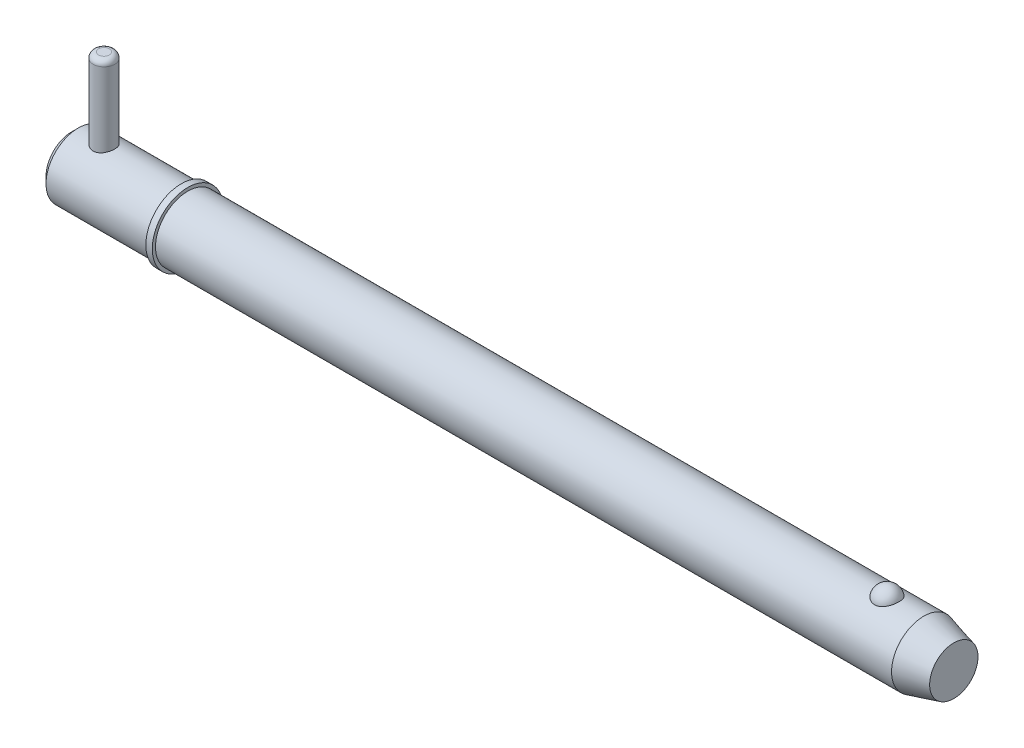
ISO-10303-21;
HEADER;
FILE_DESCRIPTION(('STEP AP214'),'2;1');
FILE_NAME('part.step','',(''),(''),'','','');
FILE_SCHEMA(('AUTOMOTIVE_DESIGN { 1 0 10303 214 1 1 1 1 }'));
ENDSEC;
DATA;
#1=APPLICATION_CONTEXT('core data for automotive mechanical design processes');
#2=APPLICATION_PROTOCOL_DEFINITION('international standard','automotive_design',2000,#1);
#3=PRODUCT_CONTEXT('',#1,'mechanical');
#4=PRODUCT('Part','Part','',(#3));
#5=PRODUCT_RELATED_PRODUCT_CATEGORY('part','',(#4));
#6=PRODUCT_DEFINITION_FORMATION('','',#4);
#7=PRODUCT_DEFINITION_CONTEXT('part definition',#1,'design');
#8=PRODUCT_DEFINITION('design','',#6,#7);
#9=PRODUCT_DEFINITION_SHAPE('','',#8);
#10=(LENGTH_UNIT() NAMED_UNIT(*) SI_UNIT(.MILLI.,.METRE.));
#11=(NAMED_UNIT(*) PLANE_ANGLE_UNIT() SI_UNIT($,.RADIAN.));
#12=(NAMED_UNIT(*) SI_UNIT($,.STERADIAN.) SOLID_ANGLE_UNIT());
#13=UNCERTAINTY_MEASURE_WITH_UNIT(LENGTH_MEASURE(1.E-05),#10,'distance_accuracy_value','');
#14=(GEOMETRIC_REPRESENTATION_CONTEXT(3) GLOBAL_UNCERTAINTY_ASSIGNED_CONTEXT((#13)) GLOBAL_UNIT_ASSIGNED_CONTEXT((#10,
#11,#12)) REPRESENTATION_CONTEXT('',''));
#15=CARTESIAN_POINT('',(0.,0.,0.));
#16=DIRECTION('',(0.,0.,1.));
#17=DIRECTION('',(1.,0.,0.));
#18=AXIS2_PLACEMENT_3D('',#15,#16,#17);
#19=CARTESIAN_POINT('',(7.14,24.605,0.));
#20=DIRECTION('',(0.,-1.,0.));
#21=DIRECTION('',(0.,0.,-1.));
#22=AXIS2_PLACEMENT_3D('',#19,#20,#21);
#23=CYLINDRICAL_SURFACE('',#22,2.38);
#24=CARTESIAN_POINT('',(7.14,-5.955,0.));
#25=DIRECTION('',(0.,1.,0.));
#26=DIRECTION('',(0.,0.,1.));
#27=AXIS2_PLACEMENT_3D('',#24,#25,#26);
#28=CIRCLE('',#27,2.38);
#29=CARTESIAN_POINT('',(7.14,-5.955,2.38));
#30=VERTEX_POINT('',#29);
#31=EDGE_CURVE('P0_E25',#30,#30,#28,.T.);
#32=ORIENTED_EDGE('',*,*,#31,.T.);
#33=EDGE_LOOP('',(#32));
#34=FACE_BOUND('',#33,.T.);
#35=CARTESIAN_POINT('',(7.14,23.415,0.));
#36=DIRECTION('',(0.,1.,0.));
#37=DIRECTION('',(0.,0.,1.));
#38=AXIS2_PLACEMENT_3D('',#35,#36,#37);
#39=CIRCLE('',#38,2.38);
#40=CARTESIAN_POINT('',(7.14,23.415,2.38));
#41=VERTEX_POINT('',#40);
#42=EDGE_CURVE('P0_E29',#41,#41,#39,.F.);
#43=ORIENTED_EDGE('',*,*,#42,.T.);
#44=EDGE_LOOP('',(#43));
#45=FACE_BOUND('',#44,.T.);
#46=ADVANCED_FACE('P0_F14',(#34,#45),#23,.T.);
#47=CARTESIAN_POINT('',(7.14,24.605,0.));
#48=DIRECTION('',(0.,1.,0.));
#49=DIRECTION('',(0.,0.,1.));
#50=AXIS2_PLACEMENT_3D('',#47,#48,#49);
#51=PLANE('',#50);
#52=CARTESIAN_POINT('',(7.14,24.605,0.));
#53=DIRECTION('',(0.,1.,0.));
#54=DIRECTION('',(0.,0.,1.));
#55=AXIS2_PLACEMENT_3D('',#52,#53,#54);
#56=CIRCLE('',#55,1.19);
#57=CARTESIAN_POINT('',(7.14,24.605,1.19));
#58=VERTEX_POINT('',#57);
#59=EDGE_CURVE('P0_E10',#58,#58,#56,.T.);
#60=ORIENTED_EDGE('',*,*,#59,.T.);
#61=EDGE_LOOP('',(#60));
#62=FACE_BOUND('',#61,.T.);
#63=ADVANCED_FACE('P0_F46',(#62),#51,.T.);
#64=CARTESIAN_POINT('',(7.14,-7.145,0.));
#65=DIRECTION('',(0.,1.,0.));
#66=DIRECTION('',(0.,0.,1.));
#67=AXIS2_PLACEMENT_3D('',#64,#65,#66);
#68=PLANE('',#67);
#69=CARTESIAN_POINT('',(7.14,-7.145,0.));
#70=DIRECTION('',(0.,1.,0.));
#71=DIRECTION('',(0.,0.,1.));
#72=AXIS2_PLACEMENT_3D('',#69,#70,#71);
#73=CIRCLE('',#72,1.19);
#74=CARTESIAN_POINT('',(7.14,-7.145,1.19));
#75=VERTEX_POINT('',#74);
#76=EDGE_CURVE('P0_E21',#75,#75,#73,.F.);
#77=ORIENTED_EDGE('',*,*,#76,.T.);
#78=EDGE_LOOP('',(#77));
#79=FACE_BOUND('',#78,.T.);
#80=ADVANCED_FACE('P0_F43',(#79),#68,.F.);
#81=CARTESIAN_POINT('',(7.14,-5.955,0.));
#82=DIRECTION('',(0.,1.,0.));
#83=DIRECTION('',(0.,0.,1.));
#84=AXIS2_PLACEMENT_3D('',#81,#82,#83);
#85=DEGENERATE_TOROIDAL_SURFACE('',#84,1.19,1.19,.T.);
#86=ORIENTED_EDGE('',*,*,#76,.F.);
#87=EDGE_LOOP('',(#86));
#88=FACE_BOUND('',#87,.T.);
#89=ORIENTED_EDGE('',*,*,#31,.F.);
#90=EDGE_LOOP('',(#89));
#91=FACE_BOUND('',#90,.T.);
#92=ADVANCED_FACE('P0_F38',(#88,#91),#85,.T.);
#93=CARTESIAN_POINT('',(7.14,23.415,0.));
#94=DIRECTION('',(0.,1.,0.));
#95=DIRECTION('',(0.,0.,1.));
#96=AXIS2_PLACEMENT_3D('',#93,#94,#95);
#97=DEGENERATE_TOROIDAL_SURFACE('',#96,1.19,1.19,.T.);
#98=ORIENTED_EDGE('',*,*,#42,.F.);
#99=EDGE_LOOP('',(#98));
#100=FACE_BOUND('',#99,.T.);
#101=ORIENTED_EDGE('',*,*,#59,.F.);
#102=EDGE_LOOP('',(#101));
#103=FACE_BOUND('',#102,.T.);
#104=ADVANCED_FACE('P0_F16',(#100,#103),#97,.T.);
#105=CLOSED_SHELL('',(#46,#63,#80,#92,#104));
#106=MANIFOLD_SOLID_BREP('P0_B1',#105);
#107=CARTESIAN_POINT('',(0.,0.,0.));
#108=DIRECTION('',(1.,0.,0.));
#109=DIRECTION('',(0.,0.,-1.));
#110=AXIS2_PLACEMENT_3D('',#107,#108,#109);
#111=CYLINDRICAL_SURFACE('',#110,7.145);
#112=CARTESIAN_POINT('',(188.88362424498,0.,0.));
#113=DIRECTION('',(1.,0.,0.));
#114=DIRECTION('',(0.,0.,-1.));
#115=AXIS2_PLACEMENT_3D('',#112,#113,#114);
#116=CIRCLE('',#115,7.145);
#117=CARTESIAN_POINT('',(188.88362424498,0.,-7.145));
#118=VERTEX_POINT('',#117);
#119=EDGE_CURVE('P1_E81',#118,#118,#116,.T.);
#120=ORIENTED_EDGE('',*,*,#119,.F.);
#121=EDGE_LOOP('',(#120));
#122=FACE_BOUND('',#121,.T.);
#123=CARTESIAN_POINT('',(25.7,0.,0.));
#124=DIRECTION('',(1.,0.,0.));
#125=DIRECTION('',(0.,0.,-1.));
#126=AXIS2_PLACEMENT_3D('',#123,#124,#125);
#127=CIRCLE('',#126,7.145);
#128=CARTESIAN_POINT('',(25.7,0.,-7.145));
#129=VERTEX_POINT('',#128);
#130=EDGE_CURVE('P1_E85',#129,#129,#127,.T.);
#131=ORIENTED_EDGE('',*,*,#130,.T.);
#132=EDGE_LOOP('',(#131));
#133=FACE_BOUND('',#132,.T.);
#134=CARTESIAN_POINT('',(180.739503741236,6.60328629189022,2.72903557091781));
#135=CARTESIAN_POINT('',(180.598315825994,6.60329644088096,2.72902496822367));
#136=CARTESIAN_POINT('',(180.456883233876,6.60799490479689,2.71772840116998));
#137=CARTESIAN_POINT('',(180.177955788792,6.62628236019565,2.67281935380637));
#138=CARTESIAN_POINT('',(180.040472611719,6.63989534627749,2.6391466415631));
#139=CARTESIAN_POINT('',(179.773889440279,6.67440775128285,2.55059642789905));
#140=CARTESIAN_POINT('',(179.644768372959,6.69528793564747,2.49577486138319));
#141=CARTESIAN_POINT('',(179.397869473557,6.74205585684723,2.36651799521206));
#142=CARTESIAN_POINT('',(179.280086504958,6.76794130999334,2.29209163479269));
#143=CARTESIAN_POINT('',(179.05516710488,6.82286177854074,2.12312937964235));
#144=CARTESIAN_POINT('',(178.948440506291,6.85196655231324,2.02807107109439));
#145=CARTESIAN_POINT('',(178.751918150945,6.90970232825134,1.82167822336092));
#146=CARTESIAN_POINT('',(178.662127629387,6.93833318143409,1.71033867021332));
#147=CARTESIAN_POINT('',(178.497667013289,6.9935167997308,1.46891951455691));
#148=CARTESIAN_POINT('',(178.423844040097,7.01992110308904,1.33822781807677));
#149=CARTESIAN_POINT('',(178.298088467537,7.06643385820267,1.06566567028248));
#150=CARTESIAN_POINT('',(178.24615735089,7.08654188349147,0.923794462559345));
#151=CARTESIAN_POINT('',(178.164732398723,7.11862399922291,0.630993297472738));
#152=CARTESIAN_POINT('',(178.135516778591,7.13049704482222,0.47997470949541));
#153=CARTESIAN_POINT('',(178.101174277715,7.14449484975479,0.174782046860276));
#154=CARTESIAN_POINT('',(178.096046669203,7.14661990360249,0.0206080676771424));
#155=CARTESIAN_POINT('',(178.109938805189,7.14092465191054,-0.285506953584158));
#156=CARTESIAN_POINT('',(178.128810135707,7.1331654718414,-0.437455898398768));
#157=CARTESIAN_POINT('',(178.190062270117,7.10859076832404,-0.735778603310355));
#158=CARTESIAN_POINT('',(178.232443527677,7.0917750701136,-0.882152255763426));
#159=CARTESIAN_POINT('',(178.339934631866,7.05076716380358,-1.165431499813));
#160=CARTESIAN_POINT('',(178.405075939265,7.02656475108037,-1.30232366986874));
#161=CARTESIAN_POINT('',(178.556759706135,6.97329145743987,-1.56265907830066));
#162=CARTESIAN_POINT('',(178.643303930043,6.94422017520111,-1.68610120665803));
#163=CARTESIAN_POINT('',(178.836465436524,6.88415108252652,-1.9167100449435));
#164=CARTESIAN_POINT('',(178.943180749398,6.85314438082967,-2.02379244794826));
#165=CARTESIAN_POINT('',(179.173974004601,6.79282069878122,-2.21787433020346));
#166=CARTESIAN_POINT('',(179.298050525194,6.76350358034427,-2.30487545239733));
#167=CARTESIAN_POINT('',(179.557678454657,6.71060580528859,-2.45458647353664));
#168=CARTESIAN_POINT('',(179.692938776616,6.68691885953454,-2.51776240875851));
#169=CARTESIAN_POINT('',(179.973277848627,6.64741247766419,-2.62030218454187));
#170=CARTESIAN_POINT('',(180.118352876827,6.63159007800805,-2.65967499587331));
#171=CARTESIAN_POINT('',(180.406347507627,6.61038594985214,-2.71193301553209));
#172=CARTESIAN_POINT('',(180.54900807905,6.60451880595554,-2.72605165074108));
#173=CARTESIAN_POINT('',(180.834800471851,6.60240611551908,-2.73116688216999));
#174=CARTESIAN_POINT('',(180.977932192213,6.60615862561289,-2.72216814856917));
#175=CARTESIAN_POINT('',(181.255848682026,6.62256094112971,-2.68200435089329));
#176=CARTESIAN_POINT('',(181.390754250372,6.63492533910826,-2.65154998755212));
#177=CARTESIAN_POINT('',(181.65332009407,6.66687445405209,-2.57015684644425));
#178=CARTESIAN_POINT('',(181.78097978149,6.68645975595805,-2.51921640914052));
#179=CARTESIAN_POINT('',(182.028577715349,6.73127274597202,-2.3969361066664));
#180=CARTESIAN_POINT('',(182.148287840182,6.75661381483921,-2.32517694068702));
#181=CARTESIAN_POINT('',(182.374159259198,6.81006003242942,-2.16363812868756));
#182=CARTESIAN_POINT('',(182.480317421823,6.83816581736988,-2.07385432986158));
#183=CARTESIAN_POINT('',(182.681862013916,6.89580469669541,-1.87357235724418));
#184=CARTESIAN_POINT('',(182.776440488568,6.92533863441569,-1.76226074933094));
#185=CARTESIAN_POINT('',(182.946332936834,6.981395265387,-1.52511696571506));
#186=CARTESIAN_POINT('',(183.021643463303,7.00791741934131,-1.39928219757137));
#187=CARTESIAN_POINT('',(183.153595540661,7.05607625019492,-1.13215977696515));
#188=CARTESIAN_POINT('',(183.209568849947,7.07753119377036,-0.990508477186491));
#189=CARTESIAN_POINT('',(183.298296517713,7.11222355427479,-0.699154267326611));
#190=CARTESIAN_POINT('',(183.331050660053,7.12546089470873,-0.549451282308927));
#191=CARTESIAN_POINT('',(183.372689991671,7.14237584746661,-0.246120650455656));
#192=CARTESIAN_POINT('',(183.381558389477,7.14604673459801,-0.0924903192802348));
#193=CARTESIAN_POINT('',(183.375194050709,7.14343510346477,0.214181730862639));
#194=CARTESIAN_POINT('',(183.359961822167,7.13715279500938,0.367223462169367));
#195=CARTESIAN_POINT('',(183.305845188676,7.1153294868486,0.667595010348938));
#196=CARTESIAN_POINT('',(183.267077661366,7.09983424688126,0.814949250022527));
#197=CARTESIAN_POINT('',(183.166770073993,7.06119140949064,1.10063221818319));
#198=CARTESIAN_POINT('',(183.105228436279,7.03804328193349,1.23896032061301));
#199=CARTESIAN_POINT('',(182.960207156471,6.98632429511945,1.50352300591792));
#200=CARTESIAN_POINT('',(182.876606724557,6.95772382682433,1.62968561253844));
#201=CARTESIAN_POINT('',(182.68938046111,6.89823072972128,1.86554304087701));
#202=CARTESIAN_POINT('',(182.585755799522,6.86733823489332,1.97523882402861));
#203=CARTESIAN_POINT('',(182.361076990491,6.80676456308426,2.17482293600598));
#204=CARTESIAN_POINT('',(182.240067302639,6.77708053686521,2.26476035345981));
#205=CARTESIAN_POINT('',(181.983340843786,6.72230501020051,2.42252989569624));
#206=CARTESIAN_POINT('',(181.84761851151,6.69721525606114,2.49035362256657));
#207=CARTESIAN_POINT('',(181.570402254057,6.65552591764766,2.59967646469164));
#208=CARTESIAN_POINT('',(181.429281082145,6.63865794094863,2.64202017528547));
#209=CARTESIAN_POINT('',(181.141444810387,6.61425039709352,2.70255841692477));
#210=CARTESIAN_POINT('',(180.994748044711,6.60668259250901,2.72082606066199));
#211=CARTESIAN_POINT('',(180.811679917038,6.60358754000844,2.72830331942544));
#212=CARTESIAN_POINT('',(180.775599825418,6.60328369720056,2.72903828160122));
#213=CARTESIAN_POINT('',(180.739503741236,6.60328629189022,2.72903557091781));
#214=B_SPLINE_CURVE_WITH_KNOTS('',3,(#134,#135,#136,#137,#138,#139,#140,#141,#142,#143,#144,
#145,#146,#147,#148,#149,#150,#151,#152,#153,#154,#155,#156,#157,#158,#159,#160,#161,#162,#163,
#164,#165,#166,#167,#168,#169,#170,#171,#172,#173,#174,#175,#176,#177,#178,#179,#180,#181,#182,
#183,#184,#185,#186,#187,#188,#189,#190,#191,#192,#193,#194,#195,#196,#197,#198,#199,#200,#201,
#202,#203,#204,#205,#206,#207,#208,#209,#210,#211,#212,#213),.UNSPECIFIED.,.T.,.F.,(4,2,2,2,2,2,
2,2,2,2,2,2,2,2,2,2,2,2,2,2,2,2,2,2,2,2,2,2,2,2,2,2,2,2,2,2,2,2,2,4),(0.,0.423468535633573,
0.848081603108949,1.27157926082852,1.69488414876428,2.13051395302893,2.56627819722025,
3.0213670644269,3.47648674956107,3.93709649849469,4.39769233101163,4.85545355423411,
5.31322361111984,5.77162895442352,6.23007210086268,6.69080337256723,7.15149693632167,
7.60264329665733,8.05361952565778,8.48189729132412,8.91008854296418,9.32472524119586,
9.73939553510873,10.1630783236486,10.5868588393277,11.0319070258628,11.4770347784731,
11.9362874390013,12.3955443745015,12.855124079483,13.3146940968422,13.7720003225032,
14.2293382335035,14.6892343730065,15.1491036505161,15.6078171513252,16.0667046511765,
16.5093965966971,16.9507410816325,17.0590049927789),.UNSPECIFIED.);
#215=CARTESIAN_POINT('',(180.739503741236,6.60328629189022,2.72903557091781));
#216=VERTEX_POINT('',#215);
#217=EDGE_CURVE('P1_E35',#216,#216,#214,.T.);
#218=ORIENTED_EDGE('',*,*,#217,.T.);
#219=EDGE_LOOP('',(#218));
#220=FACE_BOUND('',#219,.T.);
#221=ADVANCED_FACE('P1_F13',(#122,#133,#220),#111,.T.);
#222=CARTESIAN_POINT('',(0.,0.,0.));
#223=DIRECTION('',(-1.,0.,0.));
#224=DIRECTION('',(0.,0.,1.));
#225=AXIS2_PLACEMENT_3D('',#222,#223,#224);
#226=PLANE('',#225);
#227=CARTESIAN_POINT('',(0.,0.,0.));
#228=DIRECTION('',(1.,0.,0.));
#229=DIRECTION('',(0.,0.,-1.));
#230=AXIS2_PLACEMENT_3D('',#227,#228,#229);
#231=CIRCLE('',#230,5.716);
#232=CARTESIAN_POINT('',(0.,0.,-5.716));
#233=VERTEX_POINT('',#232);
#234=EDGE_CURVE('P1_E9',#233,#233,#231,.T.);
#235=ORIENTED_EDGE('',*,*,#234,.F.);
#236=EDGE_LOOP('',(#235));
#237=FACE_BOUND('',#236,.T.);
#238=ADVANCED_FACE('P1_F15',(#237),#226,.T.);
#239=CARTESIAN_POINT('',(1.42899999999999,0.,0.));
#240=DIRECTION('',(1.,0.,0.));
#241=DIRECTION('',(0.,0.,-1.));
#242=AXIS2_PLACEMENT_3D('',#239,#240,#241);
#243=CONICAL_SURFACE('',#242,7.145,0.78539816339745);
#244=ORIENTED_EDGE('',*,*,#234,.T.);
#245=EDGE_LOOP('',(#244));
#246=FACE_BOUND('',#245,.T.);
#247=CARTESIAN_POINT('',(1.42899999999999,0.,0.));
#248=DIRECTION('',(1.,0.,0.));
#249=DIRECTION('',(0.,0.,-1.));
#250=AXIS2_PLACEMENT_3D('',#247,#248,#249);
#251=CIRCLE('',#250,7.145);
#252=CARTESIAN_POINT('',(1.42899999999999,0.,-7.145));
#253=VERTEX_POINT('',#252);
#254=EDGE_CURVE('P1_E26',#253,#253,#251,.T.);
#255=ORIENTED_EDGE('',*,*,#254,.F.);
#256=EDGE_LOOP('',(#255));
#257=FACE_BOUND('',#256,.T.);
#258=ADVANCED_FACE('P1_F77',(#246,#257),#243,.T.);
#259=CARTESIAN_POINT('',(0.,0.,0.));
#260=DIRECTION('',(1.,0.,0.));
#261=DIRECTION('',(0.,0.,-1.));
#262=AXIS2_PLACEMENT_3D('',#259,#260,#261);
#263=CYLINDRICAL_SURFACE('',#262,7.145);
#264=CARTESIAN_POINT('',(7.14,-6.73695962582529,2.38));
#265=CARTESIAN_POINT('',(7.01035997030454,-6.73695921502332,2.38000059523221));
#266=CARTESIAN_POINT('',(6.88072348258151,-6.74074253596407,2.36937183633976));
#267=CARTESIAN_POINT('',(6.62529075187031,-6.75538853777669,2.32728080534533));
#268=CARTESIAN_POINT('',(6.49949514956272,-6.76625239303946,2.29581507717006));
#269=CARTESIAN_POINT('',(6.2554858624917,-6.79369535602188,2.21327763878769));
#270=CARTESIAN_POINT('',(6.13725786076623,-6.81026326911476,2.16224430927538));
#271=CARTESIAN_POINT('',(5.91100349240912,-6.84723128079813,2.04215132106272));
#272=CARTESIAN_POINT('',(5.80297937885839,-6.86763222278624,1.97308769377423));
#273=CARTESIAN_POINT('',(5.59597854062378,-6.91086152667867,1.81600414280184));
#274=CARTESIAN_POINT('',(5.49745861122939,-6.93375032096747,1.72739874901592));
#275=CARTESIAN_POINT('',(5.31636508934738,-6.97886546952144,1.53499636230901));
#276=CARTESIAN_POINT('',(5.23379405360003,-7.00109171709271,1.43119693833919));
#277=CARTESIAN_POINT('',(5.08487013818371,-7.04307708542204,1.20801318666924));
#278=CARTESIAN_POINT('',(5.01899578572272,-7.06275685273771,1.08829330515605));
#279=CARTESIAN_POINT('',(4.90850130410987,-7.09671988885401,0.838703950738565));
#280=CARTESIAN_POINT('',(4.86387545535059,-7.11100460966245,0.70883722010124));
#281=CARTESIAN_POINT('',(4.79869354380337,-7.13213998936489,0.44742990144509));
#282=CARTESIAN_POINT('',(4.77735497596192,-7.13923172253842,0.316104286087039));
#283=CARTESIAN_POINT('',(4.75686536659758,-7.14603777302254,0.0515578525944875));
#284=CARTESIAN_POINT('',(4.75770861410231,-7.14575398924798,-0.0816624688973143));
#285=CARTESIAN_POINT('',(4.78106216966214,-7.13800438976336,-0.340678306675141));
#286=CARTESIAN_POINT('',(4.80272255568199,-7.13082030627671,-0.466560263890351));
#287=CARTESIAN_POINT('',(4.86569013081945,-7.11043095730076,-0.712788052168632));
#288=CARTESIAN_POINT('',(4.90699865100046,-7.09722528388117,-0.833133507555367));
#289=CARTESIAN_POINT('',(5.00858673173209,-7.06591754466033,-1.06673173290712));
#290=CARTESIAN_POINT('',(5.06910834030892,-7.0477534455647,-1.17987058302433));
#291=CARTESIAN_POINT('',(5.20720514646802,-7.00841977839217,-1.39463797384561));
#292=CARTESIAN_POINT('',(5.28478508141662,-6.987249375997,-1.49626330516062));
#293=CARTESIAN_POINT('',(5.4590800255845,-6.94296010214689,-1.69017445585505));
#294=CARTESIAN_POINT('',(5.55652324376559,-6.91979641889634,-1.78179645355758));
#295=CARTESIAN_POINT('',(5.76558873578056,-6.87497076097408,-1.94761348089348));
#296=CARTESIAN_POINT('',(5.87721318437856,-6.85330901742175,-2.02180583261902));
#297=CARTESIAN_POINT('',(6.11357367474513,-6.81369485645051,-2.15157488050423));
#298=CARTESIAN_POINT('',(6.23847358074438,-6.79579956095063,-2.20687188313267));
#299=CARTESIAN_POINT('',(6.49655785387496,-6.76640630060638,-2.29542443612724));
#300=CARTESIAN_POINT('',(6.62973872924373,-6.75490565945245,-2.32868920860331));
#301=CARTESIAN_POINT('',(6.89417536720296,-6.74020933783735,-2.37088225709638));
#302=CARTESIAN_POINT('',(7.02524746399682,-6.73666278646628,-2.38083959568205));
#303=CARTESIAN_POINT('',(7.28721035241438,-6.73729555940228,-2.37904974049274));
#304=CARTESIAN_POINT('',(7.41810117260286,-6.7414734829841,-2.36730648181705));
#305=CARTESIAN_POINT('',(7.67130717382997,-6.75673471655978,-2.32337336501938));
#306=CARTESIAN_POINT('',(7.79376251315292,-6.76757635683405,-2.29189834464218));
#307=CARTESIAN_POINT('',(8.03162917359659,-6.79467771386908,-2.21025275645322));
#308=CARTESIAN_POINT('',(8.14703924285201,-6.8109383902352,-2.16007887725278));
#309=CARTESIAN_POINT('',(8.37159169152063,-6.84768362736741,-2.04065289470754));
#310=CARTESIAN_POINT('',(8.48041962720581,-6.86828569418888,-1.97084668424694));
#311=CARTESIAN_POINT('',(8.68518919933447,-6.91116416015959,-1.8147657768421));
#312=CARTESIAN_POINT('',(8.78112702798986,-6.93344105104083,-1.72848623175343));
#313=CARTESIAN_POINT('',(8.96215574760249,-6.97845348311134,-1.53698616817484));
#314=CARTESIAN_POINT('',(9.04650427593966,-7.00115965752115,-1.43105491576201));
#315=CARTESIAN_POINT('',(9.19627592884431,-7.04341676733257,-1.20598377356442));
#316=CARTESIAN_POINT('',(9.26169972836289,-7.06296781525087,-1.08684435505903));
#317=CARTESIAN_POINT('',(9.37116617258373,-7.0966205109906,-0.83933303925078));
#318=CARTESIAN_POINT('',(9.41534821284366,-7.11075755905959,-0.711027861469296));
#319=CARTESIAN_POINT('',(9.48132660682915,-7.13214194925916,-0.448245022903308));
#320=CARTESIAN_POINT('',(9.50313102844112,-7.13939177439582,-0.313769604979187));
#321=CARTESIAN_POINT('',(9.5230098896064,-7.14599771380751,-0.049254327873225));
#322=CARTESIAN_POINT('',(9.52215013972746,-7.14570837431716,0.0806974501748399));
#323=CARTESIAN_POINT('',(9.49935359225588,-7.13814116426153,0.338518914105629));
#324=CARTESIAN_POINT('',(9.47741850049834,-7.13086385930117,0.466388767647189));
#325=CARTESIAN_POINT('',(9.4138005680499,-7.11026814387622,0.714400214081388));
#326=CARTESIAN_POINT('',(9.37243609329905,-7.09704726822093,0.834632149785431));
#327=CARTESIAN_POINT('',(9.27142829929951,-7.06592602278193,1.06649582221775));
#328=CARTESIAN_POINT('',(9.2117816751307,-7.04802480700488,1.1781259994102));
#329=CARTESIAN_POINT('',(9.07336776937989,-7.00856499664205,1.39411030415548));
#330=CARTESIAN_POINT('',(8.99397590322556,-6.98689577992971,1.49804368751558));
#331=CARTESIAN_POINT('',(8.81938810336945,-6.9426110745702,1.69146078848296));
#332=CARTESIAN_POINT('',(8.72418713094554,-6.91999528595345,1.78093988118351));
#333=CARTESIAN_POINT('',(8.51623540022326,-6.87531507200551,1.94646188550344));
#334=CARTESIAN_POINT('',(8.4029442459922,-6.85330672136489,2.02184316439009));
#335=CARTESIAN_POINT('',(8.16461714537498,-6.81342065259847,2.1524427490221));
#336=CARTESIAN_POINT('',(8.03958429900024,-6.7955418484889,2.20766635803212));
#337=CARTESIAN_POINT('',(7.78712566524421,-6.76686117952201,2.29403636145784));
#338=CARTESIAN_POINT('',(7.66006989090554,-6.75577342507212,2.32616709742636));
#339=CARTESIAN_POINT('',(7.40200728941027,-6.74082409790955,2.36914495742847));
#340=CARTESIAN_POINT('',(7.27100183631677,-6.73696004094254,2.37999939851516));
#341=CARTESIAN_POINT('',(7.14,-6.73695962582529,2.38));
#342=B_SPLINE_CURVE_WITH_KNOTS('',3,(#264,#265,#266,#267,#268,#269,#270,#271,#272,#273,#274,
#275,#276,#277,#278,#279,#280,#281,#282,#283,#284,#285,#286,#287,#288,#289,#290,#291,#292,#293,
#294,#295,#296,#297,#298,#299,#300,#301,#302,#303,#304,#305,#306,#307,#308,#309,#310,#311,#312,
#313,#314,#315,#316,#317,#318,#319,#320,#321,#322,#323,#324,#325,#326,#327,#328,#329,#330,#331,
#332,#333,#334,#335,#336,#337,#338,#339,#340,#341),.UNSPECIFIED.,.T.,.F.,(4,2,2,2,2,2,2,2,2,2,2,
2,2,2,2,2,2,2,2,2,2,2,2,2,2,2,2,2,2,2,2,2,2,2,2,2,2,2,4),(0.,0.388434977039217,
0.776934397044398,1.16467566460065,1.55250234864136,1.9540847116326,2.35573139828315,
2.76784120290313,3.17984001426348,3.57752248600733,3.97510257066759,4.35711073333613,
4.7391447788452,5.12619663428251,5.51335611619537,5.91871976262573,6.3241456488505,
6.73533623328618,7.14635459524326,7.53885245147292,7.93127914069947,8.31025106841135,
8.68929014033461,9.08033871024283,9.47150254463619,9.88145528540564,10.2913934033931,
10.6986033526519,11.1056664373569,11.4936225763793,11.8815473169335,12.2633262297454,
12.645174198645,13.0411187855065,13.437189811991,13.8487371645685,14.2601761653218,
14.6528265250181,15.0453418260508),.UNSPECIFIED.);
#343=CARTESIAN_POINT('',(7.14,-6.73695962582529,2.38));
#344=VERTEX_POINT('',#343);
#345=EDGE_CURVE('P1_E17',#344,#344,#342,.T.);
#346=ORIENTED_EDGE('',*,*,#345,.F.);
#347=EDGE_LOOP('',(#346));
#348=FACE_BOUND('',#347,.T.);
#349=CARTESIAN_POINT('',(7.14,6.73695962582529,2.38));
#350=CARTESIAN_POINT('',(7.26964002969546,6.73695921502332,2.38000059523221));
#351=CARTESIAN_POINT('',(7.39927651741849,6.74074253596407,2.36937183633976));
#352=CARTESIAN_POINT('',(7.65470924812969,6.75538853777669,2.32728080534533));
#353=CARTESIAN_POINT('',(7.78050485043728,6.76625239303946,2.29581507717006));
#354=CARTESIAN_POINT('',(8.02451413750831,6.79369535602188,2.21327763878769));
#355=CARTESIAN_POINT('',(8.14274213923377,6.81026326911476,2.16224430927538));
#356=CARTESIAN_POINT('',(8.36899650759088,6.84723128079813,2.04215132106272));
#357=CARTESIAN_POINT('',(8.47702062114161,6.86763222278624,1.97308769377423));
#358=CARTESIAN_POINT('',(8.68402145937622,6.91086152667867,1.81600414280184));
#359=CARTESIAN_POINT('',(8.78254138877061,6.93375032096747,1.72739874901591));
#360=CARTESIAN_POINT('',(8.96363491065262,6.97886546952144,1.53499636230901));
#361=CARTESIAN_POINT('',(9.04620594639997,7.00109171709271,1.43119693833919));
#362=CARTESIAN_POINT('',(9.19512986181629,7.04307708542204,1.20801318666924));
#363=CARTESIAN_POINT('',(9.26100421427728,7.06275685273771,1.08829330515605));
#364=CARTESIAN_POINT('',(9.37149869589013,7.09671988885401,0.838703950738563));
#365=CARTESIAN_POINT('',(9.41612454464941,7.11100460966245,0.708837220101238));
#366=CARTESIAN_POINT('',(9.48130645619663,7.13213998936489,0.447429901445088));
#367=CARTESIAN_POINT('',(9.50264502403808,7.13923172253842,0.316104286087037));
#368=CARTESIAN_POINT('',(9.52313463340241,7.14603777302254,0.0515578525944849));
#369=CARTESIAN_POINT('',(9.52229138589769,7.14575398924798,-0.0816624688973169));
#370=CARTESIAN_POINT('',(9.49893783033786,7.13800438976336,-0.340678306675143));
#371=CARTESIAN_POINT('',(9.47727744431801,7.13082030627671,-0.466560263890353));
#372=CARTESIAN_POINT('',(9.41430986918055,7.11043095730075,-0.712788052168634));
#373=CARTESIAN_POINT('',(9.37300134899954,7.09722528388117,-0.833133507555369));
#374=CARTESIAN_POINT('',(9.27141326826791,7.06591754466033,-1.06673173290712));
#375=CARTESIAN_POINT('',(9.21089165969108,7.0477534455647,-1.17987058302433));
#376=CARTESIAN_POINT('',(9.07279485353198,7.00841977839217,-1.39463797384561));
#377=CARTESIAN_POINT('',(8.99521491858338,6.987249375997,-1.49626330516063));
#378=CARTESIAN_POINT('',(8.82091997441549,6.94296010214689,-1.69017445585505));
#379=CARTESIAN_POINT('',(8.72347675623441,6.91979641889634,-1.78179645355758));
#380=CARTESIAN_POINT('',(8.51441126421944,6.87497076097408,-1.94761348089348));
#381=CARTESIAN_POINT('',(8.40278681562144,6.85330901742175,-2.02180583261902));
#382=CARTESIAN_POINT('',(8.16642632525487,6.81369485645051,-2.15157488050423));
#383=CARTESIAN_POINT('',(8.04152641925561,6.79579956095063,-2.20687188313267));
#384=CARTESIAN_POINT('',(7.78344214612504,6.76640630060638,-2.29542443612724));
#385=CARTESIAN_POINT('',(7.65026127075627,6.75490565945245,-2.32868920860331));
#386=CARTESIAN_POINT('',(7.38582463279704,6.74020933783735,-2.37088225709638));
#387=CARTESIAN_POINT('',(7.25475253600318,6.73666278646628,-2.38083959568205));
#388=CARTESIAN_POINT('',(6.99278964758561,6.73729555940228,-2.37904974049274));
#389=CARTESIAN_POINT('',(6.86189882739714,6.7414734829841,-2.36730648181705));
#390=CARTESIAN_POINT('',(6.60869282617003,6.75673471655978,-2.32337336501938));
#391=CARTESIAN_POINT('',(6.48623748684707,6.76757635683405,-2.29189834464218));
#392=CARTESIAN_POINT('',(6.2483708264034,6.79467771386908,-2.21025275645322));
#393=CARTESIAN_POINT('',(6.13296075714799,6.8109383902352,-2.16007887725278));
#394=CARTESIAN_POINT('',(5.90840830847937,6.84768362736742,-2.04065289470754));
#395=CARTESIAN_POINT('',(5.79958037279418,6.86828569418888,-1.97084668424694));
#396=CARTESIAN_POINT('',(5.59481080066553,6.91116416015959,-1.8147657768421));
#397=CARTESIAN_POINT('',(5.49887297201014,6.93344105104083,-1.72848623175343));
#398=CARTESIAN_POINT('',(5.31784425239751,6.97845348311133,-1.53698616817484));
#399=CARTESIAN_POINT('',(5.23349572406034,7.00115965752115,-1.43105491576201));
#400=CARTESIAN_POINT('',(5.08372407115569,7.04341676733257,-1.20598377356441));
#401=CARTESIAN_POINT('',(5.01830027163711,7.06296781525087,-1.08684435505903));
#402=CARTESIAN_POINT('',(4.90883382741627,7.0966205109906,-0.839333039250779));
#403=CARTESIAN_POINT('',(4.86465178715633,7.11075755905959,-0.711027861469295));
#404=CARTESIAN_POINT('',(4.79867339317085,7.13214194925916,-0.448245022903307));
#405=CARTESIAN_POINT('',(4.77686897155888,7.13939177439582,-0.313769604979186));
#406=CARTESIAN_POINT('',(4.7569901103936,7.14599771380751,-0.0492543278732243));
#407=CARTESIAN_POINT('',(4.75784986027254,7.14570837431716,0.0806974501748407));
#408=CARTESIAN_POINT('',(4.78064640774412,7.13814116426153,0.33851891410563));
#409=CARTESIAN_POINT('',(4.80258149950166,7.13086385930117,0.46638876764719));
#410=CARTESIAN_POINT('',(4.8661994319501,7.11026814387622,0.714400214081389));
#411=CARTESIAN_POINT('',(4.90756390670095,7.09704726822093,0.834632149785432));
#412=CARTESIAN_POINT('',(5.00857170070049,7.06592602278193,1.06649582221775));
#413=CARTESIAN_POINT('',(5.0682183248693,7.04802480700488,1.1781259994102));
#414=CARTESIAN_POINT('',(5.20663223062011,7.00856499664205,1.39411030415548));
#415=CARTESIAN_POINT('',(5.28602409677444,6.98689577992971,1.49804368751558));
#416=CARTESIAN_POINT('',(5.46061189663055,6.9426110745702,1.69146078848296));
#417=CARTESIAN_POINT('',(5.55581286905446,6.91999528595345,1.78093988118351));
#418=CARTESIAN_POINT('',(5.76376459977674,6.87531507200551,1.94646188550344));
#419=CARTESIAN_POINT('',(5.8770557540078,6.85330672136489,2.02184316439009));
#420=CARTESIAN_POINT('',(6.11538285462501,6.81342065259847,2.1524427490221));
#421=CARTESIAN_POINT('',(6.24041570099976,6.7955418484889,2.20766635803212));
#422=CARTESIAN_POINT('',(6.4928743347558,6.76686117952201,2.29403636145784));
#423=CARTESIAN_POINT('',(6.61993010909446,6.75577342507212,2.32616709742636));
#424=CARTESIAN_POINT('',(6.87799271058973,6.74082409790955,2.36914495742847));
#425=CARTESIAN_POINT('',(7.00899816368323,6.73696004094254,2.37999939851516));
#426=CARTESIAN_POINT('',(7.14,6.73695962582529,2.38));
#427=B_SPLINE_CURVE_WITH_KNOTS('',3,(#349,#350,#351,#352,#353,#354,#355,#356,#357,#358,#359,
#360,#361,#362,#363,#364,#365,#366,#367,#368,#369,#370,#371,#372,#373,#374,#375,#376,#377,#378,
#379,#380,#381,#382,#383,#384,#385,#386,#387,#388,#389,#390,#391,#392,#393,#394,#395,#396,#397,
#398,#399,#400,#401,#402,#403,#404,#405,#406,#407,#408,#409,#410,#411,#412,#413,#414,#415,#416,
#417,#418,#419,#420,#421,#422,#423,#424,#425,#426),.UNSPECIFIED.,.T.,.F.,(4,2,2,2,2,2,2,2,2,2,2,
2,2,2,2,2,2,2,2,2,2,2,2,2,2,2,2,2,2,2,2,2,2,2,2,2,2,2,4),(0.,0.388434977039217,
0.776934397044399,1.16467566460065,1.55250234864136,1.9540847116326,2.35573139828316,
2.76784120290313,3.17984001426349,3.57752248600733,3.97510257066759,4.35711073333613,
4.73914477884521,5.12619663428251,5.51335611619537,5.91871976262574,6.3241456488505,
6.73533623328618,7.14635459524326,7.53885245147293,7.93127914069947,8.31025106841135,
8.68929014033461,9.08033871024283,9.47150254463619,9.88145528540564,10.2913934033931,
10.6986033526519,11.1056664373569,11.4936225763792,11.8815473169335,12.2633262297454,
12.645174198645,13.0411187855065,13.437189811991,13.8487371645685,14.2601761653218,
14.6528265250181,15.0453418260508),.UNSPECIFIED.);
#428=CARTESIAN_POINT('',(7.14,6.73695962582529,2.38));
#429=VERTEX_POINT('',#428);
#430=EDGE_CURVE('P1_E43',#429,#429,#427,.T.);
#431=ORIENTED_EDGE('',*,*,#430,.F.);
#432=EDGE_LOOP('',(#431));
#433=FACE_BOUND('',#432,.T.);
#434=ORIENTED_EDGE('',*,*,#254,.T.);
#435=EDGE_LOOP('',(#434));
#436=FACE_BOUND('',#435,.T.);
#437=CARTESIAN_POINT('',(24.271,0.,0.));
#438=DIRECTION('',(1.,0.,0.));
#439=DIRECTION('',(0.,0.,-1.));
#440=AXIS2_PLACEMENT_3D('',#437,#438,#439);
#441=CIRCLE('',#440,7.145);
#442=CARTESIAN_POINT('',(24.271,0.,-7.145));
#443=VERTEX_POINT('',#442);
#444=EDGE_CURVE('P1_E31',#443,#443,#441,.T.);
#445=ORIENTED_EDGE('',*,*,#444,.F.);
#446=EDGE_LOOP('',(#445));
#447=FACE_BOUND('',#446,.T.);
#448=ADVANCED_FACE('P1_F103',(#348,#433,#436,#447),#263,.T.);
#449=CARTESIAN_POINT('',(24.271,7.145,0.));
#450=DIRECTION('',(-1.,0.,0.));
#451=DIRECTION('',(0.,0.,1.));
#452=AXIS2_PLACEMENT_3D('',#449,#450,#451);
#453=PLANE('',#452);
#454=ORIENTED_EDGE('',*,*,#444,.T.);
#455=EDGE_LOOP('',(#454));
#456=FACE_BOUND('',#455,.T.);
#457=CARTESIAN_POINT('',(24.271,0.,0.));
#458=DIRECTION('',(1.,0.,0.));
#459=DIRECTION('',(0.,0.,-1.));
#460=AXIS2_PLACEMENT_3D('',#457,#458,#459);
#461=CIRCLE('',#460,7.8595);
#462=CARTESIAN_POINT('',(24.271,0.,-7.8595));
#463=VERTEX_POINT('',#462);
#464=EDGE_CURVE('P1_E91',#463,#463,#461,.T.);
#465=ORIENTED_EDGE('',*,*,#464,.F.);
#466=EDGE_LOOP('',(#465));
#467=FACE_BOUND('',#466,.T.);
#468=ADVANCED_FACE('P1_F100',(#456,#467),#453,.T.);
#469=CARTESIAN_POINT('',(0.,0.,0.));
#470=DIRECTION('',(1.,0.,0.));
#471=DIRECTION('',(0.,0.,-1.));
#472=AXIS2_PLACEMENT_3D('',#469,#470,#471);
#473=CYLINDRICAL_SURFACE('',#472,7.8595);
#474=ORIENTED_EDGE('',*,*,#464,.T.);
#475=EDGE_LOOP('',(#474));
#476=FACE_BOUND('',#475,.T.);
#477=CARTESIAN_POINT('',(25.7,0.,0.));
#478=DIRECTION('',(1.,0.,0.));
#479=DIRECTION('',(0.,0.,-1.));
#480=AXIS2_PLACEMENT_3D('',#477,#478,#479);
#481=CIRCLE('',#480,7.8595);
#482=CARTESIAN_POINT('',(25.7,0.,-7.8595));
#483=VERTEX_POINT('',#482);
#484=EDGE_CURVE('P1_E88',#483,#483,#481,.T.);
#485=ORIENTED_EDGE('',*,*,#484,.F.);
#486=EDGE_LOOP('',(#485));
#487=FACE_BOUND('',#486,.T.);
#488=ADVANCED_FACE('P1_F68',(#476,#487),#473,.T.);
#489=CARTESIAN_POINT('',(25.7,7.8595,0.));
#490=DIRECTION('',(1.,0.,0.));
#491=DIRECTION('',(0.,0.,-1.));
#492=AXIS2_PLACEMENT_3D('',#489,#490,#491);
#493=PLANE('',#492);
#494=ORIENTED_EDGE('',*,*,#484,.T.);
#495=EDGE_LOOP('',(#494));
#496=FACE_BOUND('',#495,.T.);
#497=ORIENTED_EDGE('',*,*,#130,.F.);
#498=EDGE_LOOP('',(#497));
#499=FACE_BOUND('',#498,.T.);
#500=ADVANCED_FACE('P1_F62',(#496,#499),#493,.T.);
#501=CARTESIAN_POINT('',(195.55,0.,0.));
#502=DIRECTION('',(-1.,0.,0.));
#503=DIRECTION('',(0.,0.,1.));
#504=AXIS2_PLACEMENT_3D('',#501,#502,#503);
#505=CONICAL_SURFACE('',#504,5.35875000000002,0.26179938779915);
#506=ORIENTED_EDGE('',*,*,#119,.T.);
#507=EDGE_LOOP('',(#506));
#508=FACE_BOUND('',#507,.T.);
#509=CARTESIAN_POINT('',(195.55,0.,0.));
#510=DIRECTION('',(1.,0.,0.));
#511=DIRECTION('',(0.,0.,-1.));
#512=AXIS2_PLACEMENT_3D('',#509,#510,#511);
#513=CIRCLE('',#512,5.35875000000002);
#514=CARTESIAN_POINT('',(195.55,0.,-5.35875000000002));
#515=VERTEX_POINT('',#514);
#516=EDGE_CURVE('P1_E42',#515,#515,#513,.T.);
#517=ORIENTED_EDGE('',*,*,#516,.F.);
#518=EDGE_LOOP('',(#517));
#519=FACE_BOUND('',#518,.T.);
#520=ADVANCED_FACE('P1_F59',(#508,#519),#505,.T.);
#521=CARTESIAN_POINT('',(195.55,5.35875000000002,0.));
#522=DIRECTION('',(1.,0.,0.));
#523=DIRECTION('',(0.,0.,-1.));
#524=AXIS2_PLACEMENT_3D('',#521,#522,#523);
#525=PLANE('',#524);
#526=ORIENTED_EDGE('',*,*,#516,.T.);
#527=EDGE_LOOP('',(#526));
#528=FACE_BOUND('',#527,.T.);
#529=ADVANCED_FACE('P1_F55',(#528),#525,.T.);
#530=CARTESIAN_POINT('',(180.739503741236,6.4305,0.));
#531=DIRECTION('',(-1.,0.,0.));
#532=DIRECTION('',(0.,-1.,0.));
#533=AXIS2_PLACEMENT_3D('',#530,#531,#532);
#534=SPHERICAL_SURFACE('',#533,2.73449999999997);
#535=ORIENTED_EDGE('',*,*,#217,.F.);
#536=EDGE_LOOP('',(#535));
#537=FACE_BOUND('',#536,.T.);
#538=ADVANCED_FACE('P1_F50',(#537),#534,.T.);
#539=CARTESIAN_POINT('',(7.14,-7.8595,0.));
#540=DIRECTION('',(0.,1.,0.));
#541=DIRECTION('',(0.,0.,1.));
#542=AXIS2_PLACEMENT_3D('',#539,#540,#541);
#543=CYLINDRICAL_SURFACE('',#542,2.38);
#544=ORIENTED_EDGE('',*,*,#345,.T.);
#545=EDGE_LOOP('',(#544));
#546=FACE_BOUND('',#545,.T.);
#547=ORIENTED_EDGE('',*,*,#430,.T.);
#548=EDGE_LOOP('',(#547));
#549=FACE_BOUND('',#548,.T.);
#550=ADVANCED_FACE('P1_F54',(#546,#549),#543,.F.);
#551=CLOSED_SHELL('',(#221,#238,#258,#448,#468,#488,#500,#520,#529,#538,#550));
#552=MANIFOLD_SOLID_BREP('P1_B1',#551);
#553=ADVANCED_BREP_SHAPE_REPRESENTATION('',(#18,#106,#552),#14);
#554=SHAPE_DEFINITION_REPRESENTATION(#9,#553);
ENDSEC;
END-ISO-10303-21;
